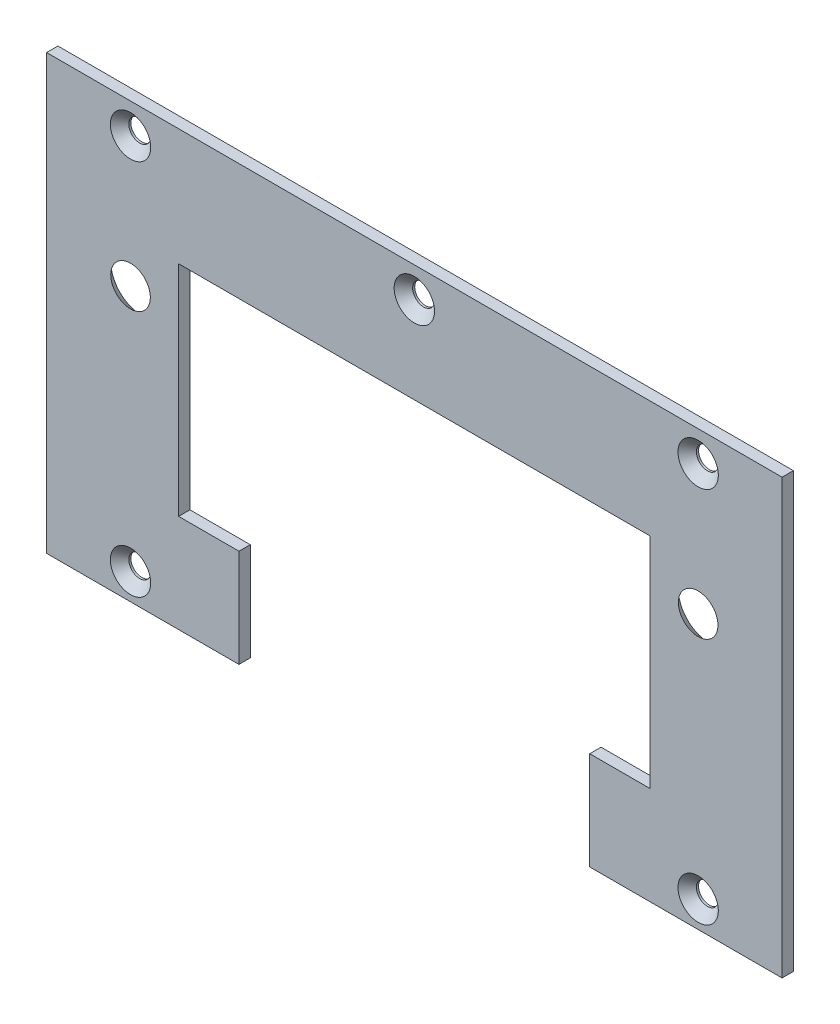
ISO-10303-21;
HEADER;
FILE_DESCRIPTION(('STEP AP214'),'2;1');
FILE_NAME('part.step','',(''),(''),'','','');
FILE_SCHEMA(('AUTOMOTIVE_DESIGN { 1 0 10303 214 1 1 1 1 }'));
ENDSEC;
DATA;
#1=APPLICATION_CONTEXT('core data for automotive mechanical design processes');
#2=APPLICATION_PROTOCOL_DEFINITION('international standard','automotive_design',2000,#1);
#3=PRODUCT_CONTEXT('',#1,'mechanical');
#4=PRODUCT('Part','Part','',(#3));
#5=PRODUCT_RELATED_PRODUCT_CATEGORY('part','',(#4));
#6=PRODUCT_DEFINITION_FORMATION('','',#4);
#7=PRODUCT_DEFINITION_CONTEXT('part definition',#1,'design');
#8=PRODUCT_DEFINITION('design','',#6,#7);
#9=PRODUCT_DEFINITION_SHAPE('','',#8);
#10=(LENGTH_UNIT() NAMED_UNIT(*) SI_UNIT(.MILLI.,.METRE.));
#11=(NAMED_UNIT(*) PLANE_ANGLE_UNIT() SI_UNIT($,.RADIAN.));
#12=(NAMED_UNIT(*) SI_UNIT($,.STERADIAN.) SOLID_ANGLE_UNIT());
#13=UNCERTAINTY_MEASURE_WITH_UNIT(LENGTH_MEASURE(1.E-05),#10,'distance_accuracy_value','');
#14=(GEOMETRIC_REPRESENTATION_CONTEXT(3) GLOBAL_UNCERTAINTY_ASSIGNED_CONTEXT((#13)) GLOBAL_UNIT_ASSIGNED_CONTEXT((#10,
#11,#12)) REPRESENTATION_CONTEXT('',''));
#15=CARTESIAN_POINT('',(0.,0.,0.));
#16=DIRECTION('',(0.,0.,1.));
#17=DIRECTION('',(1.,0.,0.));
#18=AXIS2_PLACEMENT_3D('',#15,#16,#17);
#19=CARTESIAN_POINT('',(0.,48.424882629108,0.));
#20=DIRECTION('',(0.,0.,1.));
#21=DIRECTION('',(1.,0.,0.));
#22=AXIS2_PLACEMENT_3D('',#19,#20,#21);
#23=PLANE('',#22);
#24=CARTESIAN_POINT('',(-75.25,-8.00000000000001,0.));
#25=DIRECTION('',(0.,0.,1.));
#26=DIRECTION('',(1.,0.,0.));
#27=AXIS2_PLACEMENT_3D('',#24,#25,#26);
#28=CIRCLE('',#27,5.34999999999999);
#29=CARTESIAN_POINT('',(-69.9,-8.00000000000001,0.));
#30=VERTEX_POINT('',#29);
#31=EDGE_CURVE('E125',#30,#30,#28,.F.);
#32=ORIENTED_EDGE('',*,*,#31,.T.);
#33=EDGE_LOOP('',(#32));
#34=FACE_BOUND('',#33,.T.);
#35=CARTESIAN_POINT('',(-75.25,92.,0.));
#36=DIRECTION('',(0.,0.,1.));
#37=DIRECTION('',(1.,0.,0.));
#38=AXIS2_PLACEMENT_3D('',#35,#36,#37);
#39=CIRCLE('',#38,5.34999999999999);
#40=CARTESIAN_POINT('',(-69.9,92.,0.));
#41=VERTEX_POINT('',#40);
#42=EDGE_CURVE('E161',#41,#41,#39,.F.);
#43=ORIENTED_EDGE('',*,*,#42,.T.);
#44=EDGE_LOOP('',(#43));
#45=FACE_BOUND('',#44,.T.);
#46=CARTESIAN_POINT('',(0.,92.,0.));
#47=DIRECTION('',(0.,0.,1.));
#48=DIRECTION('',(1.,0.,0.));
#49=AXIS2_PLACEMENT_3D('',#46,#47,#48);
#50=CIRCLE('',#49,5.35);
#51=CARTESIAN_POINT('',(5.35000000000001,92.,0.));
#52=VERTEX_POINT('',#51);
#53=EDGE_CURVE('E164',#52,#52,#50,.F.);
#54=ORIENTED_EDGE('',*,*,#53,.T.);
#55=EDGE_LOOP('',(#54));
#56=FACE_BOUND('',#55,.T.);
#57=CARTESIAN_POINT('',(75.25,92.,0.));
#58=DIRECTION('',(0.,0.,1.));
#59=DIRECTION('',(1.,0.,0.));
#60=AXIS2_PLACEMENT_3D('',#57,#58,#59);
#61=CIRCLE('',#60,5.35);
#62=CARTESIAN_POINT('',(80.6,92.,0.));
#63=VERTEX_POINT('',#62);
#64=EDGE_CURVE('E166',#63,#63,#61,.F.);
#65=ORIENTED_EDGE('',*,*,#64,.T.);
#66=EDGE_LOOP('',(#65));
#67=FACE_BOUND('',#66,.T.);
#68=CARTESIAN_POINT('',(75.25,-8.,0.));
#69=DIRECTION('',(0.,0.,1.));
#70=DIRECTION('',(1.,0.,0.));
#71=AXIS2_PLACEMENT_3D('',#68,#69,#70);
#72=CIRCLE('',#71,5.35);
#73=CARTESIAN_POINT('',(80.6,-8.,0.));
#74=VERTEX_POINT('',#73);
#75=EDGE_CURVE('E19',#74,#74,#72,.F.);
#76=ORIENTED_EDGE('',*,*,#75,.T.);
#77=EDGE_LOOP('',(#76));
#78=FACE_BOUND('',#77,.T.);
#79=CARTESIAN_POINT('',(75.25,57.5,0.));
#80=DIRECTION('',(0.,0.,-1.));
#81=DIRECTION('',(-1.,0.,0.));
#82=AXIS2_PLACEMENT_3D('',#79,#80,#81);
#83=CIRCLE('',#82,5.25000000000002);
#84=CARTESIAN_POINT('',(70.,57.5,0.));
#85=VERTEX_POINT('',#84);
#86=EDGE_CURVE('E152',#85,#85,#83,.T.);
#87=ORIENTED_EDGE('',*,*,#86,.T.);
#88=EDGE_LOOP('',(#87));
#89=FACE_BOUND('',#88,.T.);
#90=CARTESIAN_POINT('',(-75.25,57.5,0.));
#91=DIRECTION('',(0.,0.,-1.));
#92=DIRECTION('',(-1.,0.,0.));
#93=AXIS2_PLACEMENT_3D('',#90,#91,#92);
#94=CIRCLE('',#93,5.25);
#95=CARTESIAN_POINT('',(-80.5,57.5,0.));
#96=VERTEX_POINT('',#95);
#97=EDGE_CURVE('E156',#96,#96,#94,.T.);
#98=ORIENTED_EDGE('',*,*,#97,.T.);
#99=EDGE_LOOP('',(#98));
#100=FACE_BOUND('',#99,.T.);
#101=DIRECTION('',(0.,1.,0.));
#102=VECTOR('',#101,1.);
#103=CARTESIAN_POINT('',(-97.5,100.,0.));
#104=LINE('',#103,#102);
#105=CARTESIAN_POINT('',(-97.5,-15.,0.));
#106=VERTEX_POINT('',#105);
#107=CARTESIAN_POINT('',(-97.5,100.,0.));
#108=VERTEX_POINT('',#107);
#109=EDGE_CURVE('E370',#106,#108,#104,.T.);
#110=ORIENTED_EDGE('',*,*,#109,.F.);
#111=DIRECTION('',(1.,0.,0.));
#112=VECTOR('',#111,1.);
#113=CARTESIAN_POINT('',(-97.5,-15.,0.));
#114=LINE('',#113,#112);
#115=CARTESIAN_POINT('',(-46.5,-15.,0.));
#116=VERTEX_POINT('',#115);
#117=EDGE_CURVE('E366',#116,#106,#114,.F.);
#118=ORIENTED_EDGE('',*,*,#117,.F.);
#119=DIRECTION('',(0.,1.,0.));
#120=VECTOR('',#119,1.);
#121=CARTESIAN_POINT('',(-46.5,-15.,0.));
#122=LINE('',#121,#120);
#123=CARTESIAN_POINT('',(-46.5,11.,0.));
#124=VERTEX_POINT('',#123);
#125=EDGE_CURVE('E363',#124,#116,#122,.F.);
#126=ORIENTED_EDGE('',*,*,#125,.F.);
#127=DIRECTION('',(1.,0.,0.));
#128=VECTOR('',#127,1.);
#129=CARTESIAN_POINT('',(-46.5,11.,0.));
#130=LINE('',#129,#128);
#131=CARTESIAN_POINT('',(-62.5,11.,0.));
#132=VERTEX_POINT('',#131);
#133=EDGE_CURVE('E121',#132,#124,#130,.T.);
#134=ORIENTED_EDGE('',*,*,#133,.F.);
#135=DIRECTION('',(0.,1.,0.));
#136=VECTOR('',#135,1.);
#137=CARTESIAN_POINT('',(-62.5,11.,0.));
#138=LINE('',#137,#136);
#139=CARTESIAN_POINT('',(-62.5,69.,0.));
#140=VERTEX_POINT('',#139);
#141=EDGE_CURVE('E116',#140,#132,#138,.F.);
#142=ORIENTED_EDGE('',*,*,#141,.F.);
#143=DIRECTION('',(1.,0.,0.));
#144=VECTOR('',#143,1.);
#145=CARTESIAN_POINT('',(-62.5,69.,0.));
#146=LINE('',#145,#144);
#147=CARTESIAN_POINT('',(62.5,69.,0.));
#148=VERTEX_POINT('',#147);
#149=EDGE_CURVE('E107',#148,#140,#146,.F.);
#150=ORIENTED_EDGE('',*,*,#149,.F.);
#151=DIRECTION('',(0.,1.,0.));
#152=VECTOR('',#151,1.);
#153=CARTESIAN_POINT('',(62.5,69.,0.));
#154=LINE('',#153,#152);
#155=CARTESIAN_POINT('',(62.5,11.,0.));
#156=VERTEX_POINT('',#155);
#157=EDGE_CURVE('E102',#156,#148,#154,.T.);
#158=ORIENTED_EDGE('',*,*,#157,.F.);
#159=DIRECTION('',(1.,0.,0.));
#160=VECTOR('',#159,1.);
#161=CARTESIAN_POINT('',(62.5,11.,0.));
#162=LINE('',#161,#160);
#163=CARTESIAN_POINT('',(46.5,11.,0.));
#164=VERTEX_POINT('',#163);
#165=EDGE_CURVE('E390',#164,#156,#162,.T.);
#166=ORIENTED_EDGE('',*,*,#165,.F.);
#167=DIRECTION('',(0.,1.,0.));
#168=VECTOR('',#167,1.);
#169=CARTESIAN_POINT('',(46.5,11.,0.));
#170=LINE('',#169,#168);
#171=CARTESIAN_POINT('',(46.5,-15.,0.));
#172=VERTEX_POINT('',#171);
#173=EDGE_CURVE('E386',#172,#164,#170,.T.);
#174=ORIENTED_EDGE('',*,*,#173,.F.);
#175=DIRECTION('',(1.,0.,0.));
#176=VECTOR('',#175,1.);
#177=CARTESIAN_POINT('',(46.5,-15.,0.));
#178=LINE('',#177,#176);
#179=CARTESIAN_POINT('',(97.5,-15.,0.));
#180=VERTEX_POINT('',#179);
#181=EDGE_CURVE('E382',#180,#172,#178,.F.);
#182=ORIENTED_EDGE('',*,*,#181,.F.);
#183=DIRECTION('',(0.,1.,0.));
#184=VECTOR('',#183,1.);
#185=CARTESIAN_POINT('',(97.5,-15.,0.));
#186=LINE('',#185,#184);
#187=CARTESIAN_POINT('',(97.5,100.,0.));
#188=VERTEX_POINT('',#187);
#189=EDGE_CURVE('E378',#188,#180,#186,.F.);
#190=ORIENTED_EDGE('',*,*,#189,.F.);
#191=DIRECTION('',(1.,0.,0.));
#192=VECTOR('',#191,1.);
#193=CARTESIAN_POINT('',(97.5,100.,0.));
#194=LINE('',#193,#192);
#195=EDGE_CURVE('E374',#108,#188,#194,.T.);
#196=ORIENTED_EDGE('',*,*,#195,.F.);
#197=EDGE_LOOP('',(#110,#118,#126,#134,#142,#150,#158,#166,#174,#182,#190,#196));
#198=FACE_BOUND('',#197,.T.);
#199=ADVANCED_FACE('F15',(#34,#45,#56,#67,#78,#89,#100,#198),#23,.T.);
#200=CARTESIAN_POINT('',(75.25,-8.,0.));
#201=DIRECTION('',(0.,0.,1.));
#202=DIRECTION('',(1.,0.,0.));
#203=AXIS2_PLACEMENT_3D('',#200,#201,#202);
#204=CONICAL_SURFACE('',#203,5.34999999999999,0.785398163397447);
#205=CARTESIAN_POINT('',(75.25,-8.,-2.44999999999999));
#206=DIRECTION('',(0.,0.,-1.));
#207=DIRECTION('',(-1.,0.,0.));
#208=AXIS2_PLACEMENT_3D('',#205,#206,#207);
#209=CIRCLE('',#208,2.9);
#210=CARTESIAN_POINT('',(72.35,-8.,-2.44999999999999));
#211=VERTEX_POINT('',#210);
#212=EDGE_CURVE('E155',#211,#211,#209,.T.);
#213=ORIENTED_EDGE('',*,*,#212,.T.);
#214=EDGE_LOOP('',(#213));
#215=FACE_BOUND('',#214,.T.);
#216=ORIENTED_EDGE('',*,*,#75,.F.);
#217=EDGE_LOOP('',(#216));
#218=FACE_BOUND('',#217,.T.);
#219=ADVANCED_FACE('F175',(#215,#218),#204,.F.);
#220=CARTESIAN_POINT('',(75.25,92.,0.));
#221=DIRECTION('',(0.,0.,1.));
#222=DIRECTION('',(1.,0.,0.));
#223=AXIS2_PLACEMENT_3D('',#220,#221,#222);
#224=CONICAL_SURFACE('',#223,5.34999999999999,0.785398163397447);
#225=CARTESIAN_POINT('',(75.25,92.,-2.44999999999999));
#226=DIRECTION('',(0.,0.,-1.));
#227=DIRECTION('',(-1.,0.,0.));
#228=AXIS2_PLACEMENT_3D('',#225,#226,#227);
#229=CIRCLE('',#228,2.89999999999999);
#230=CARTESIAN_POINT('',(72.35,92.,-2.44999999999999));
#231=VERTEX_POINT('',#230);
#232=EDGE_CURVE('E348',#231,#231,#229,.T.);
#233=ORIENTED_EDGE('',*,*,#232,.T.);
#234=EDGE_LOOP('',(#233));
#235=FACE_BOUND('',#234,.T.);
#236=ORIENTED_EDGE('',*,*,#64,.F.);
#237=EDGE_LOOP('',(#236));
#238=FACE_BOUND('',#237,.T.);
#239=ADVANCED_FACE('F177',(#235,#238),#224,.F.);
#240=CARTESIAN_POINT('',(0.,92.,0.));
#241=DIRECTION('',(0.,0.,1.));
#242=DIRECTION('',(1.,0.,0.));
#243=AXIS2_PLACEMENT_3D('',#240,#241,#242);
#244=CONICAL_SURFACE('',#243,5.35,0.785398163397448);
#245=CARTESIAN_POINT('',(0.,92.,-2.44999999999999));
#246=DIRECTION('',(0.,0.,-1.));
#247=DIRECTION('',(-1.,0.,0.));
#248=AXIS2_PLACEMENT_3D('',#245,#246,#247);
#249=CIRCLE('',#248,2.9);
#250=CARTESIAN_POINT('',(-2.89999999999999,92.,-2.44999999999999));
#251=VERTEX_POINT('',#250);
#252=EDGE_CURVE('E343',#251,#251,#249,.T.);
#253=ORIENTED_EDGE('',*,*,#252,.T.);
#254=EDGE_LOOP('',(#253));
#255=FACE_BOUND('',#254,.T.);
#256=ORIENTED_EDGE('',*,*,#53,.F.);
#257=EDGE_LOOP('',(#256));
#258=FACE_BOUND('',#257,.T.);
#259=ADVANCED_FACE('F185',(#255,#258),#244,.F.);
#260=CARTESIAN_POINT('',(-75.25,92.,0.));
#261=DIRECTION('',(0.,0.,1.));
#262=DIRECTION('',(1.,0.,0.));
#263=AXIS2_PLACEMENT_3D('',#260,#261,#262);
#264=CONICAL_SURFACE('',#263,5.34999999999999,0.785398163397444);
#265=CARTESIAN_POINT('',(-75.25,92.,-2.44999999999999));
#266=DIRECTION('',(0.,0.,-1.));
#267=DIRECTION('',(-1.,0.,0.));
#268=AXIS2_PLACEMENT_3D('',#265,#266,#267);
#269=CIRCLE('',#268,2.9);
#270=CARTESIAN_POINT('',(-78.15,92.,-2.44999999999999));
#271=VERTEX_POINT('',#270);
#272=EDGE_CURVE('E286',#271,#271,#269,.T.);
#273=ORIENTED_EDGE('',*,*,#272,.T.);
#274=EDGE_LOOP('',(#273));
#275=FACE_BOUND('',#274,.T.);
#276=ORIENTED_EDGE('',*,*,#42,.F.);
#277=EDGE_LOOP('',(#276));
#278=FACE_BOUND('',#277,.T.);
#279=ADVANCED_FACE('F249',(#275,#278),#264,.F.);
#280=CARTESIAN_POINT('',(-75.25,-8.00000000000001,0.));
#281=DIRECTION('',(0.,0.,1.));
#282=DIRECTION('',(1.,0.,0.));
#283=AXIS2_PLACEMENT_3D('',#280,#281,#282);
#284=CONICAL_SURFACE('',#283,5.34999999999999,0.785398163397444);
#285=CARTESIAN_POINT('',(-75.25,-8.,-2.44999999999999));
#286=DIRECTION('',(0.,0.,-1.));
#287=DIRECTION('',(-1.,0.,0.));
#288=AXIS2_PLACEMENT_3D('',#285,#286,#287);
#289=CIRCLE('',#288,2.90000000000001);
#290=CARTESIAN_POINT('',(-78.15,-8.,-2.44999999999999));
#291=VERTEX_POINT('',#290);
#292=EDGE_CURVE('E338',#291,#291,#289,.T.);
#293=ORIENTED_EDGE('',*,*,#292,.T.);
#294=EDGE_LOOP('',(#293));
#295=FACE_BOUND('',#294,.T.);
#296=ORIENTED_EDGE('',*,*,#31,.F.);
#297=EDGE_LOOP('',(#296));
#298=FACE_BOUND('',#297,.T.);
#299=ADVANCED_FACE('F245',(#295,#298),#284,.F.);
#300=CARTESIAN_POINT('',(-62.5,11.,0.));
#301=DIRECTION('',(1.,0.,0.));
#302=DIRECTION('',(0.,0.,-1.));
#303=AXIS2_PLACEMENT_3D('',#300,#301,#302);
#304=PLANE('',#303);
#305=ORIENTED_EDGE('',*,*,#141,.T.);
#306=DIRECTION('',(0.,0.,1.));
#307=VECTOR('',#306,1.);
#308=CARTESIAN_POINT('',(-62.5,11.,0.));
#309=LINE('',#308,#307);
#310=CARTESIAN_POINT('',(-62.5,11.,-3.));
#311=VERTEX_POINT('',#310);
#312=EDGE_CURVE('E360',#311,#132,#309,.T.);
#313=ORIENTED_EDGE('',*,*,#312,.F.);
#314=DIRECTION('',(0.,1.,0.));
#315=VECTOR('',#314,1.);
#316=CARTESIAN_POINT('',(-62.5,48.424882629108,-3.));
#317=LINE('',#316,#315);
#318=CARTESIAN_POINT('',(-62.5,69.,-3.));
#319=VERTEX_POINT('',#318);
#320=EDGE_CURVE('E129',#311,#319,#317,.T.);
#321=ORIENTED_EDGE('',*,*,#320,.T.);
#322=DIRECTION('',(0.,0.,-1.));
#323=VECTOR('',#322,1.);
#324=CARTESIAN_POINT('',(-62.5,69.,0.));
#325=LINE('',#324,#323);
#326=EDGE_CURVE('E112',#140,#319,#325,.T.);
#327=ORIENTED_EDGE('',*,*,#326,.F.);
#328=EDGE_LOOP('',(#305,#313,#321,#327));
#329=FACE_BOUND('',#328,.T.);
#330=ADVANCED_FACE('F128',(#329),#304,.T.);
#331=CARTESIAN_POINT('',(-62.5,69.,0.));
#332=DIRECTION('',(0.,-1.,0.));
#333=DIRECTION('',(0.,0.,-1.));
#334=AXIS2_PLACEMENT_3D('',#331,#332,#333);
#335=PLANE('',#334);
#336=ORIENTED_EDGE('',*,*,#149,.T.);
#337=ORIENTED_EDGE('',*,*,#326,.T.);
#338=DIRECTION('',(1.,0.,0.));
#339=VECTOR('',#338,1.);
#340=CARTESIAN_POINT('',(0.,69.,-3.));
#341=LINE('',#340,#339);
#342=CARTESIAN_POINT('',(62.5,69.,-3.));
#343=VERTEX_POINT('',#342);
#344=EDGE_CURVE('E335',#319,#343,#341,.T.);
#345=ORIENTED_EDGE('',*,*,#344,.T.);
#346=DIRECTION('',(0.,0.,1.));
#347=VECTOR('',#346,1.);
#348=CARTESIAN_POINT('',(62.5,69.,0.));
#349=LINE('',#348,#347);
#350=EDGE_CURVE('E114',#148,#343,#349,.F.);
#351=ORIENTED_EDGE('',*,*,#350,.F.);
#352=EDGE_LOOP('',(#336,#337,#345,#351));
#353=FACE_BOUND('',#352,.T.);
#354=ADVANCED_FACE('F109',(#353),#335,.T.);
#355=CARTESIAN_POINT('',(62.5,69.,0.));
#356=DIRECTION('',(-1.,0.,0.));
#357=DIRECTION('',(0.,0.,1.));
#358=AXIS2_PLACEMENT_3D('',#355,#356,#357);
#359=PLANE('',#358);
#360=ORIENTED_EDGE('',*,*,#157,.T.);
#361=ORIENTED_EDGE('',*,*,#350,.T.);
#362=DIRECTION('',(0.,1.,0.));
#363=VECTOR('',#362,1.);
#364=CARTESIAN_POINT('',(62.5,48.424882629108,-3.));
#365=LINE('',#364,#363);
#366=CARTESIAN_POINT('',(62.5,11.,-3.));
#367=VERTEX_POINT('',#366);
#368=EDGE_CURVE('E332',#343,#367,#365,.F.);
#369=ORIENTED_EDGE('',*,*,#368,.T.);
#370=DIRECTION('',(0.,0.,1.));
#371=VECTOR('',#370,1.);
#372=CARTESIAN_POINT('',(62.5,11.,0.));
#373=LINE('',#372,#371);
#374=EDGE_CURVE('E388',#156,#367,#373,.F.);
#375=ORIENTED_EDGE('',*,*,#374,.F.);
#376=EDGE_LOOP('',(#360,#361,#369,#375));
#377=FACE_BOUND('',#376,.T.);
#378=ADVANCED_FACE('F238',(#377),#359,.T.);
#379=CARTESIAN_POINT('',(62.5,11.,0.));
#380=DIRECTION('',(0.,1.,0.));
#381=DIRECTION('',(0.,0.,1.));
#382=AXIS2_PLACEMENT_3D('',#379,#380,#381);
#383=PLANE('',#382);
#384=ORIENTED_EDGE('',*,*,#165,.T.);
#385=ORIENTED_EDGE('',*,*,#374,.T.);
#386=DIRECTION('',(1.,0.,0.));
#387=VECTOR('',#386,1.);
#388=CARTESIAN_POINT('',(0.,11.,-3.));
#389=LINE('',#388,#387);
#390=CARTESIAN_POINT('',(46.5,11.,-3.));
#391=VERTEX_POINT('',#390);
#392=EDGE_CURVE('E329',#367,#391,#389,.F.);
#393=ORIENTED_EDGE('',*,*,#392,.T.);
#394=DIRECTION('',(0.,0.,1.));
#395=VECTOR('',#394,1.);
#396=CARTESIAN_POINT('',(46.5,11.,0.));
#397=LINE('',#396,#395);
#398=EDGE_CURVE('E384',#164,#391,#397,.F.);
#399=ORIENTED_EDGE('',*,*,#398,.F.);
#400=EDGE_LOOP('',(#384,#385,#393,#399));
#401=FACE_BOUND('',#400,.T.);
#402=ADVANCED_FACE('F234',(#401),#383,.T.);
#403=CARTESIAN_POINT('',(46.5,11.,0.));
#404=DIRECTION('',(-1.,0.,0.));
#405=DIRECTION('',(0.,0.,1.));
#406=AXIS2_PLACEMENT_3D('',#403,#404,#405);
#407=PLANE('',#406);
#408=ORIENTED_EDGE('',*,*,#173,.T.);
#409=ORIENTED_EDGE('',*,*,#398,.T.);
#410=DIRECTION('',(0.,1.,0.));
#411=VECTOR('',#410,1.);
#412=CARTESIAN_POINT('',(46.5,48.424882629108,-3.));
#413=LINE('',#412,#411);
#414=CARTESIAN_POINT('',(46.5,-15.,-3.));
#415=VERTEX_POINT('',#414);
#416=EDGE_CURVE('E326',#391,#415,#413,.F.);
#417=ORIENTED_EDGE('',*,*,#416,.T.);
#418=DIRECTION('',(0.,0.,-1.));
#419=VECTOR('',#418,1.);
#420=CARTESIAN_POINT('',(46.5,-15.,0.));
#421=LINE('',#420,#419);
#422=EDGE_CURVE('E380',#172,#415,#421,.T.);
#423=ORIENTED_EDGE('',*,*,#422,.F.);
#424=EDGE_LOOP('',(#408,#409,#417,#423));
#425=FACE_BOUND('',#424,.T.);
#426=ADVANCED_FACE('F230',(#425),#407,.T.);
#427=CARTESIAN_POINT('',(46.5,-15.,0.));
#428=DIRECTION('',(0.,-1.,0.));
#429=DIRECTION('',(0.,0.,-1.));
#430=AXIS2_PLACEMENT_3D('',#427,#428,#429);
#431=PLANE('',#430);
#432=ORIENTED_EDGE('',*,*,#181,.T.);
#433=ORIENTED_EDGE('',*,*,#422,.T.);
#434=DIRECTION('',(1.,0.,0.));
#435=VECTOR('',#434,1.);
#436=CARTESIAN_POINT('',(0.,-15.,-3.));
#437=LINE('',#436,#435);
#438=CARTESIAN_POINT('',(97.5,-15.,-3.));
#439=VERTEX_POINT('',#438);
#440=EDGE_CURVE('E323',#415,#439,#437,.T.);
#441=ORIENTED_EDGE('',*,*,#440,.T.);
#442=DIRECTION('',(0.,0.,-1.));
#443=VECTOR('',#442,1.);
#444=CARTESIAN_POINT('',(97.5,-15.,0.));
#445=LINE('',#444,#443);
#446=EDGE_CURVE('E376',#180,#439,#445,.T.);
#447=ORIENTED_EDGE('',*,*,#446,.F.);
#448=EDGE_LOOP('',(#432,#433,#441,#447));
#449=FACE_BOUND('',#448,.T.);
#450=ADVANCED_FACE('F226',(#449),#431,.T.);
#451=CARTESIAN_POINT('',(97.5,-15.,0.));
#452=DIRECTION('',(1.,0.,0.));
#453=DIRECTION('',(0.,0.,-1.));
#454=AXIS2_PLACEMENT_3D('',#451,#452,#453);
#455=PLANE('',#454);
#456=ORIENTED_EDGE('',*,*,#189,.T.);
#457=ORIENTED_EDGE('',*,*,#446,.T.);
#458=DIRECTION('',(0.,1.,0.));
#459=VECTOR('',#458,1.);
#460=CARTESIAN_POINT('',(97.5,48.424882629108,-3.));
#461=LINE('',#460,#459);
#462=CARTESIAN_POINT('',(97.5,100.,-3.));
#463=VERTEX_POINT('',#462);
#464=EDGE_CURVE('E320',#439,#463,#461,.T.);
#465=ORIENTED_EDGE('',*,*,#464,.T.);
#466=DIRECTION('',(0.,0.,1.));
#467=VECTOR('',#466,1.);
#468=CARTESIAN_POINT('',(97.5,100.,0.));
#469=LINE('',#468,#467);
#470=EDGE_CURVE('E372',#188,#463,#469,.F.);
#471=ORIENTED_EDGE('',*,*,#470,.F.);
#472=EDGE_LOOP('',(#456,#457,#465,#471));
#473=FACE_BOUND('',#472,.T.);
#474=ADVANCED_FACE('F222',(#473),#455,.T.);
#475=CARTESIAN_POINT('',(97.5,100.,0.));
#476=DIRECTION('',(0.,1.,0.));
#477=DIRECTION('',(0.,0.,1.));
#478=AXIS2_PLACEMENT_3D('',#475,#476,#477);
#479=PLANE('',#478);
#480=ORIENTED_EDGE('',*,*,#195,.T.);
#481=ORIENTED_EDGE('',*,*,#470,.T.);
#482=DIRECTION('',(1.,0.,0.));
#483=VECTOR('',#482,1.);
#484=CARTESIAN_POINT('',(0.,100.,-3.));
#485=LINE('',#484,#483);
#486=CARTESIAN_POINT('',(-97.5,100.,-3.));
#487=VERTEX_POINT('',#486);
#488=EDGE_CURVE('E314',#463,#487,#485,.F.);
#489=ORIENTED_EDGE('',*,*,#488,.T.);
#490=DIRECTION('',(0.,0.,1.));
#491=VECTOR('',#490,1.);
#492=CARTESIAN_POINT('',(-97.5,100.,0.));
#493=LINE('',#492,#491);
#494=EDGE_CURVE('E368',#108,#487,#493,.F.);
#495=ORIENTED_EDGE('',*,*,#494,.F.);
#496=EDGE_LOOP('',(#480,#481,#489,#495));
#497=FACE_BOUND('',#496,.T.);
#498=ADVANCED_FACE('F218',(#497),#479,.T.);
#499=CARTESIAN_POINT('',(-97.5,100.,0.));
#500=DIRECTION('',(-1.,0.,0.));
#501=DIRECTION('',(0.,0.,1.));
#502=AXIS2_PLACEMENT_3D('',#499,#500,#501);
#503=PLANE('',#502);
#504=ORIENTED_EDGE('',*,*,#109,.T.);
#505=ORIENTED_EDGE('',*,*,#494,.T.);
#506=DIRECTION('',(0.,1.,0.));
#507=VECTOR('',#506,1.);
#508=CARTESIAN_POINT('',(-97.5,48.424882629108,-3.));
#509=LINE('',#508,#507);
#510=CARTESIAN_POINT('',(-97.5,-15.,-3.));
#511=VERTEX_POINT('',#510);
#512=EDGE_CURVE('E312',#487,#511,#509,.F.);
#513=ORIENTED_EDGE('',*,*,#512,.T.);
#514=DIRECTION('',(0.,0.,-1.));
#515=VECTOR('',#514,1.);
#516=CARTESIAN_POINT('',(-97.5,-15.,0.));
#517=LINE('',#516,#515);
#518=EDGE_CURVE('E311',#106,#511,#517,.T.);
#519=ORIENTED_EDGE('',*,*,#518,.F.);
#520=EDGE_LOOP('',(#504,#505,#513,#519));
#521=FACE_BOUND('',#520,.T.);
#522=ADVANCED_FACE('F214',(#521),#503,.T.);
#523=CARTESIAN_POINT('',(-97.5,-15.,0.));
#524=DIRECTION('',(0.,-1.,0.));
#525=DIRECTION('',(0.,0.,-1.));
#526=AXIS2_PLACEMENT_3D('',#523,#524,#525);
#527=PLANE('',#526);
#528=ORIENTED_EDGE('',*,*,#117,.T.);
#529=ORIENTED_EDGE('',*,*,#518,.T.);
#530=DIRECTION('',(1.,0.,0.));
#531=VECTOR('',#530,1.);
#532=CARTESIAN_POINT('',(0.,-15.,-3.));
#533=LINE('',#532,#531);
#534=CARTESIAN_POINT('',(-46.5,-15.,-3.));
#535=VERTEX_POINT('',#534);
#536=EDGE_CURVE('E305',#511,#535,#533,.T.);
#537=ORIENTED_EDGE('',*,*,#536,.T.);
#538=DIRECTION('',(0.,0.,-1.));
#539=VECTOR('',#538,1.);
#540=CARTESIAN_POINT('',(-46.5,-15.,0.));
#541=LINE('',#540,#539);
#542=EDGE_CURVE('E309',#116,#535,#541,.T.);
#543=ORIENTED_EDGE('',*,*,#542,.F.);
#544=EDGE_LOOP('',(#528,#529,#537,#543));
#545=FACE_BOUND('',#544,.T.);
#546=ADVANCED_FACE('F210',(#545),#527,.T.);
#547=CARTESIAN_POINT('',(-46.5,-15.,0.));
#548=DIRECTION('',(1.,0.,0.));
#549=DIRECTION('',(0.,0.,-1.));
#550=AXIS2_PLACEMENT_3D('',#547,#548,#549);
#551=PLANE('',#550);
#552=ORIENTED_EDGE('',*,*,#125,.T.);
#553=ORIENTED_EDGE('',*,*,#542,.T.);
#554=DIRECTION('',(0.,1.,0.));
#555=VECTOR('',#554,1.);
#556=CARTESIAN_POINT('',(-46.5,48.424882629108,-3.));
#557=LINE('',#556,#555);
#558=CARTESIAN_POINT('',(-46.5,11.,-3.));
#559=VERTEX_POINT('',#558);
#560=EDGE_CURVE('E302',#535,#559,#557,.T.);
#561=ORIENTED_EDGE('',*,*,#560,.T.);
#562=DIRECTION('',(0.,0.,1.));
#563=VECTOR('',#562,1.);
#564=CARTESIAN_POINT('',(-46.5,11.,0.));
#565=LINE('',#564,#563);
#566=EDGE_CURVE('E34',#124,#559,#565,.F.);
#567=ORIENTED_EDGE('',*,*,#566,.F.);
#568=EDGE_LOOP('',(#552,#553,#561,#567));
#569=FACE_BOUND('',#568,.T.);
#570=ADVANCED_FACE('F207',(#569),#551,.T.);
#571=CARTESIAN_POINT('',(-46.5,11.,0.));
#572=DIRECTION('',(0.,1.,0.));
#573=DIRECTION('',(0.,0.,1.));
#574=AXIS2_PLACEMENT_3D('',#571,#572,#573);
#575=PLANE('',#574);
#576=ORIENTED_EDGE('',*,*,#133,.T.);
#577=ORIENTED_EDGE('',*,*,#566,.T.);
#578=DIRECTION('',(1.,0.,0.));
#579=VECTOR('',#578,1.);
#580=CARTESIAN_POINT('',(0.,11.,-3.));
#581=LINE('',#580,#579);
#582=EDGE_CURVE('E151',#559,#311,#581,.F.);
#583=ORIENTED_EDGE('',*,*,#582,.T.);
#584=ORIENTED_EDGE('',*,*,#312,.T.);
#585=EDGE_LOOP('',(#576,#577,#583,#584));
#586=FACE_BOUND('',#585,.T.);
#587=ADVANCED_FACE('F203',(#586),#575,.T.);
#588=CARTESIAN_POINT('',(-75.25,57.5,-3.));
#589=DIRECTION('',(0.,0.,-1.));
#590=DIRECTION('',(-1.,0.,0.));
#591=AXIS2_PLACEMENT_3D('',#588,#589,#590);
#592=CONICAL_SURFACE('',#591,8.25000000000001,0.785398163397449);
#593=CARTESIAN_POINT('',(-75.25,57.5,-2.99999999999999));
#594=DIRECTION('',(0.,0.,-1.));
#595=DIRECTION('',(-1.,0.,0.));
#596=AXIS2_PLACEMENT_3D('',#593,#594,#595);
#597=CIRCLE('',#596,8.24999999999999);
#598=CARTESIAN_POINT('',(-83.5,57.5,-2.99999999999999));
#599=VERTEX_POINT('',#598);
#600=EDGE_CURVE('E148',#599,#599,#597,.T.);
#601=ORIENTED_EDGE('',*,*,#600,.T.);
#602=EDGE_LOOP('',(#601));
#603=FACE_BOUND('',#602,.T.);
#604=ORIENTED_EDGE('',*,*,#97,.F.);
#605=EDGE_LOOP('',(#604));
#606=FACE_BOUND('',#605,.T.);
#607=ADVANCED_FACE('F206',(#603,#606),#592,.F.);
#608=CARTESIAN_POINT('',(75.25,57.5,-3.));
#609=DIRECTION('',(0.,0.,-1.));
#610=DIRECTION('',(-1.,0.,0.));
#611=AXIS2_PLACEMENT_3D('',#608,#609,#610);
#612=CONICAL_SURFACE('',#611,8.25000000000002,0.785398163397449);
#613=CARTESIAN_POINT('',(75.25,57.5,-2.99999999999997));
#614=DIRECTION('',(0.,0.,-1.));
#615=DIRECTION('',(-1.,0.,0.));
#616=AXIS2_PLACEMENT_3D('',#613,#614,#615);
#617=CIRCLE('',#616,8.24999999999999);
#618=CARTESIAN_POINT('',(67.,57.5,-2.99999999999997));
#619=VERTEX_POINT('',#618);
#620=EDGE_CURVE('E145',#619,#619,#617,.T.);
#621=ORIENTED_EDGE('',*,*,#620,.T.);
#622=EDGE_LOOP('',(#621));
#623=FACE_BOUND('',#622,.T.);
#624=ORIENTED_EDGE('',*,*,#86,.F.);
#625=EDGE_LOOP('',(#624));
#626=FACE_BOUND('',#625,.T.);
#627=ADVANCED_FACE('F263',(#623,#626),#612,.F.);
#628=CARTESIAN_POINT('',(75.25,-8.,-2.44999999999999));
#629=DIRECTION('',(0.,0.,-1.));
#630=DIRECTION('',(-1.,0.,0.));
#631=AXIS2_PLACEMENT_3D('',#628,#629,#630);
#632=CYLINDRICAL_SURFACE('',#631,2.9);
#633=ORIENTED_EDGE('',*,*,#212,.F.);
#634=EDGE_LOOP('',(#633));
#635=FACE_BOUND('',#634,.T.);
#636=CARTESIAN_POINT('',(75.25,-8.,-3.));
#637=DIRECTION('',(0.,0.,-1.));
#638=DIRECTION('',(-1.,0.,0.));
#639=AXIS2_PLACEMENT_3D('',#636,#637,#638);
#640=CIRCLE('',#639,2.9);
#641=CARTESIAN_POINT('',(72.35,-8.,-3.));
#642=VERTEX_POINT('',#641);
#643=EDGE_CURVE('E142',#642,#642,#640,.T.);
#644=ORIENTED_EDGE('',*,*,#643,.T.);
#645=EDGE_LOOP('',(#644));
#646=FACE_BOUND('',#645,.T.);
#647=ADVANCED_FACE('F267',(#635,#646),#632,.F.);
#648=CARTESIAN_POINT('',(75.25,92.,-2.44999999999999));
#649=DIRECTION('',(0.,0.,-1.));
#650=DIRECTION('',(-1.,0.,0.));
#651=AXIS2_PLACEMENT_3D('',#648,#649,#650);
#652=CYLINDRICAL_SURFACE('',#651,2.89999999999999);
#653=ORIENTED_EDGE('',*,*,#232,.F.);
#654=EDGE_LOOP('',(#653));
#655=FACE_BOUND('',#654,.T.);
#656=CARTESIAN_POINT('',(75.25,92.,-3.));
#657=DIRECTION('',(0.,0.,-1.));
#658=DIRECTION('',(-1.,0.,0.));
#659=AXIS2_PLACEMENT_3D('',#656,#657,#658);
#660=CIRCLE('',#659,2.89999999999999);
#661=CARTESIAN_POINT('',(72.35,92.,-3.));
#662=VERTEX_POINT('',#661);
#663=EDGE_CURVE('E139',#662,#662,#660,.T.);
#664=ORIENTED_EDGE('',*,*,#663,.T.);
#665=EDGE_LOOP('',(#664));
#666=FACE_BOUND('',#665,.T.);
#667=ADVANCED_FACE('F271',(#655,#666),#652,.F.);
#668=CARTESIAN_POINT('',(0.,92.,-2.44999999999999));
#669=DIRECTION('',(0.,0.,-1.));
#670=DIRECTION('',(-1.,0.,0.));
#671=AXIS2_PLACEMENT_3D('',#668,#669,#670);
#672=CYLINDRICAL_SURFACE('',#671,2.9);
#673=ORIENTED_EDGE('',*,*,#252,.F.);
#674=EDGE_LOOP('',(#673));
#675=FACE_BOUND('',#674,.T.);
#676=CARTESIAN_POINT('',(0.,92.,-3.));
#677=DIRECTION('',(0.,0.,-1.));
#678=DIRECTION('',(-1.,0.,0.));
#679=AXIS2_PLACEMENT_3D('',#676,#677,#678);
#680=CIRCLE('',#679,2.9);
#681=CARTESIAN_POINT('',(-2.89999999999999,92.,-3.));
#682=VERTEX_POINT('',#681);
#683=EDGE_CURVE('E136',#682,#682,#680,.T.);
#684=ORIENTED_EDGE('',*,*,#683,.T.);
#685=EDGE_LOOP('',(#684));
#686=FACE_BOUND('',#685,.T.);
#687=ADVANCED_FACE('F275',(#675,#686),#672,.F.);
#688=CARTESIAN_POINT('',(-75.25,92.,-2.44999999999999));
#689=DIRECTION('',(0.,0.,-1.));
#690=DIRECTION('',(-1.,0.,0.));
#691=AXIS2_PLACEMENT_3D('',#688,#689,#690);
#692=CYLINDRICAL_SURFACE('',#691,2.9);
#693=ORIENTED_EDGE('',*,*,#272,.F.);
#694=EDGE_LOOP('',(#693));
#695=FACE_BOUND('',#694,.T.);
#696=CARTESIAN_POINT('',(-75.25,92.,-3.));
#697=DIRECTION('',(0.,0.,-1.));
#698=DIRECTION('',(-1.,0.,0.));
#699=AXIS2_PLACEMENT_3D('',#696,#697,#698);
#700=CIRCLE('',#699,2.9);
#701=CARTESIAN_POINT('',(-78.15,92.,-3.));
#702=VERTEX_POINT('',#701);
#703=EDGE_CURVE('E25',#702,#702,#700,.T.);
#704=ORIENTED_EDGE('',*,*,#703,.T.);
#705=EDGE_LOOP('',(#704));
#706=FACE_BOUND('',#705,.T.);
#707=ADVANCED_FACE('F198',(#695,#706),#692,.F.);
#708=CARTESIAN_POINT('',(-75.25,-8.,-2.44999999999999));
#709=DIRECTION('',(0.,0.,-1.));
#710=DIRECTION('',(-1.,0.,0.));
#711=AXIS2_PLACEMENT_3D('',#708,#709,#710);
#712=CYLINDRICAL_SURFACE('',#711,2.90000000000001);
#713=ORIENTED_EDGE('',*,*,#292,.F.);
#714=EDGE_LOOP('',(#713));
#715=FACE_BOUND('',#714,.T.);
#716=CARTESIAN_POINT('',(-75.25,-8.,-3.));
#717=DIRECTION('',(0.,0.,-1.));
#718=DIRECTION('',(-1.,0.,0.));
#719=AXIS2_PLACEMENT_3D('',#716,#717,#718);
#720=CIRCLE('',#719,2.90000000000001);
#721=CARTESIAN_POINT('',(-78.15,-8.,-3.));
#722=VERTEX_POINT('',#721);
#723=EDGE_CURVE('E10',#722,#722,#720,.T.);
#724=ORIENTED_EDGE('',*,*,#723,.T.);
#725=EDGE_LOOP('',(#724));
#726=FACE_BOUND('',#725,.T.);
#727=ADVANCED_FACE('F17',(#715,#726),#712,.F.);
#728=CARTESIAN_POINT('',(0.,48.424882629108,-3.));
#729=DIRECTION('',(0.,0.,1.));
#730=DIRECTION('',(1.,0.,0.));
#731=AXIS2_PLACEMENT_3D('',#728,#729,#730);
#732=PLANE('',#731);
#733=ORIENTED_EDGE('',*,*,#723,.F.);
#734=EDGE_LOOP('',(#733));
#735=FACE_BOUND('',#734,.T.);
#736=ORIENTED_EDGE('',*,*,#703,.F.);
#737=EDGE_LOOP('',(#736));
#738=FACE_BOUND('',#737,.T.);
#739=ORIENTED_EDGE('',*,*,#683,.F.);
#740=EDGE_LOOP('',(#739));
#741=FACE_BOUND('',#740,.T.);
#742=ORIENTED_EDGE('',*,*,#663,.F.);
#743=EDGE_LOOP('',(#742));
#744=FACE_BOUND('',#743,.T.);
#745=ORIENTED_EDGE('',*,*,#643,.F.);
#746=EDGE_LOOP('',(#745));
#747=FACE_BOUND('',#746,.T.);
#748=ORIENTED_EDGE('',*,*,#620,.F.);
#749=EDGE_LOOP('',(#748));
#750=FACE_BOUND('',#749,.T.);
#751=ORIENTED_EDGE('',*,*,#600,.F.);
#752=EDGE_LOOP('',(#751));
#753=FACE_BOUND('',#752,.T.);
#754=ORIENTED_EDGE('',*,*,#560,.F.);
#755=ORIENTED_EDGE('',*,*,#536,.F.);
#756=ORIENTED_EDGE('',*,*,#512,.F.);
#757=ORIENTED_EDGE('',*,*,#488,.F.);
#758=ORIENTED_EDGE('',*,*,#464,.F.);
#759=ORIENTED_EDGE('',*,*,#440,.F.);
#760=ORIENTED_EDGE('',*,*,#416,.F.);
#761=ORIENTED_EDGE('',*,*,#392,.F.);
#762=ORIENTED_EDGE('',*,*,#368,.F.);
#763=ORIENTED_EDGE('',*,*,#344,.F.);
#764=ORIENTED_EDGE('',*,*,#320,.F.);
#765=ORIENTED_EDGE('',*,*,#582,.F.);
#766=EDGE_LOOP('',(#754,#755,#756,#757,#758,#759,#760,#761,#762,#763,#764,#765));
#767=FACE_BOUND('',#766,.T.);
#768=ADVANCED_FACE('F191',(#735,#738,#741,#744,#747,#750,#753,#767),#732,.F.);
#769=CLOSED_SHELL('',(#199,#219,#239,#259,#279,#299,#330,#354,#378,#402,#426,#450,#474,#498,
#522,#546,#570,#587,#607,#627,#647,#667,#687,#707,#727,#768));
#770=MANIFOLD_SOLID_BREP('B1',#769);
#771=ADVANCED_BREP_SHAPE_REPRESENTATION('',(#18,#770),#14);
#772=SHAPE_DEFINITION_REPRESENTATION(#9,#771);
ENDSEC;
END-ISO-10303-21;
